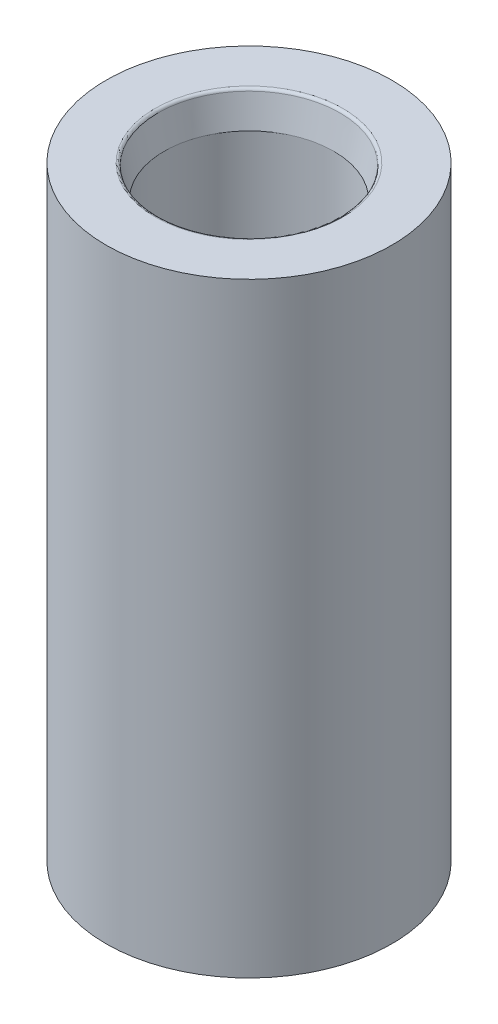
from build123d import *

# Parameters (mm, degrees)
SKETCH1_W          = 11.938
SKETCH1_H          = 50.8
SKETCH24_R         = 3.175
CUT_EXTRUDE1_DEPTH = 54.290991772


with BuildPart() as part:
    # Sketch1 → Revolve1 (revolve)
    with BuildSketch(Plane.XY, mode=Mode.PRIVATE) as revolve1_sk:
        with Locations((-5.969, 12.7)):
            Rectangle(SKETCH1_W, SKETCH1_H)
    revolve(revolve1_sk.sketch.rotate(Axis((0, -18.420388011, 0), (0, 1, 0)), 270), axis=Axis((0, -18.420388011, 0), (0, 1, 0)))

    # Port Sketch2 → SAE Port2 (revolve, cut)
    with BuildSketch(Plane(origin=(2.291254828, 38.1, -2.024191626), x_dir=(-0.749432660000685, 0, 0.6620805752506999), z_dir=(0.6620805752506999, 0, 0.749432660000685)), mode=Mode.PRIVATE) as sae_port2_sk:
        with BuildLine():
            Line((3.057319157, 35.938507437), (9.605439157, 32.004))
            Line((9.605439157, 32.004), (9.605439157, 12.954))
            Line((9.605439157, 12.954), (10.201069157, 12.954))
            Line((10.201069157, 12.954), (10.201069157, 2.880662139))
            Line((10.201069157, 2.880662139), (10.127731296, 2.954))
            Line((10.127731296, 2.954), (10.658869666, 0.455190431))
            ThreePointArc((10.658869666, 0.455190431), (10.747471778, 0.310604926), (10.907319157, 0.254))
            Line((10.907319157, 0.254), (15.557319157, 0.254))
            Line((15.557319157, 0.254), (15.557319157, 0))
            Line((15.557319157, 0), (3.057319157, 0))
            Line((3.057319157, 0), (3.057319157, 35.938507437))
        make_face()
    revolve(sae_port2_sk.sketch.rotate(Axis((0, 38.1, 0), (0, -1, 0)), 311.458742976), axis=Axis((0, 38.1, 0), (0, -1, 0)), mode=Mode.SUBTRACT)

    # Sketch24 → Cut-Extrude1 (cut, through all)
    with BuildSketch(Plane.XZ.offset(12.7)):
        with Locations(Location((0, 0, 0), (0, 0, 270))):
            Circle(SKETCH24_R)
    extrude(amount=-CUT_EXTRUDE1_DEPTH, mode=Mode.SUBTRACT)


solid = part.part
